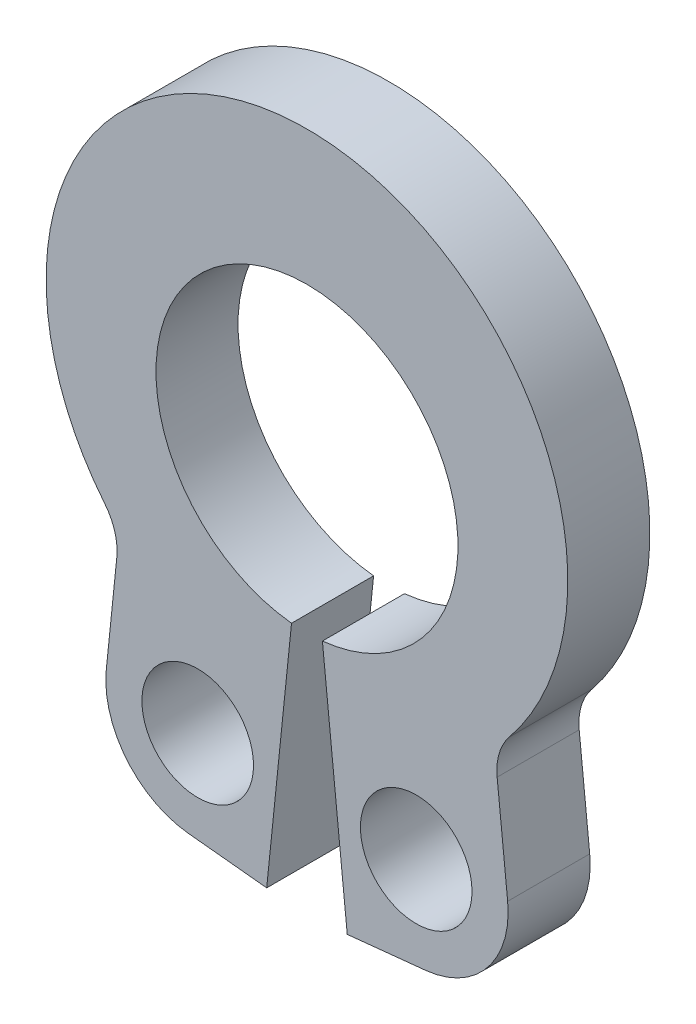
from build123d import *

# Parameters (mm, degrees)
BODY_DEPTH  = 0.635
HOLSKE_R    = 0.4318
HOLES_DEPTH = 4.697280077


with BuildPart() as part:
    # BodySke → Body (new body)
    with BuildSketch(Plane.XY):
        with BuildLine():
            Line((0.119485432, -1.162274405), (0.311701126, -3.032020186))
            Line((0.311701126, -3.032020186), (0.918105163, -2.969679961))
            ThreePointArc((0.918105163, -2.969679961), (1.39706077, -2.71103833), (1.552846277, -2.189478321))
            Line((1.552846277, -2.189478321), (1.471509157, -1.398285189))
            ThreePointArc((1.471509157, -1.398285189), (1.487288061, -1.230611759), (1.566008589, -1.081727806))
            ThreePointArc((1.566008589, -1.081727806), (0, 2.2098), (-1.566008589, -1.081727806))
            ThreePointArc((-1.566008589, -1.081727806), (-1.487288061, -1.230611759), (-1.471509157, -1.398285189))
            Line((-1.471509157, -1.398285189), (-1.552846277, -2.189478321))
            ThreePointArc((-1.552846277, -2.189478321), (-1.39706077, -2.71103833), (-0.918105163, -2.969679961))
            Line((-0.918105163, -2.969679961), (-0.311701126, -3.032020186))
            Line((-0.311701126, -3.032020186), (-0.119485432, -1.162274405))
            ThreePointArc((-0.119485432, -1.162274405), (0, 1.1684), (0.119485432, -1.162274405))
        make_face()
    extrude(amount=-BODY_DEPTH)

    # HolSke → Holes (cut, through all)
    with BuildSketch(Plane.XY):
        with Locations((0.8453749, -2.262208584)):
            Circle(HOLSKE_R)
        with Locations((-0.8453749, -2.262208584)):
            Circle(HOLSKE_R)
    extrude(amount=-HOLES_DEPTH, mode=Mode.SUBTRACT)


solid = part.part
